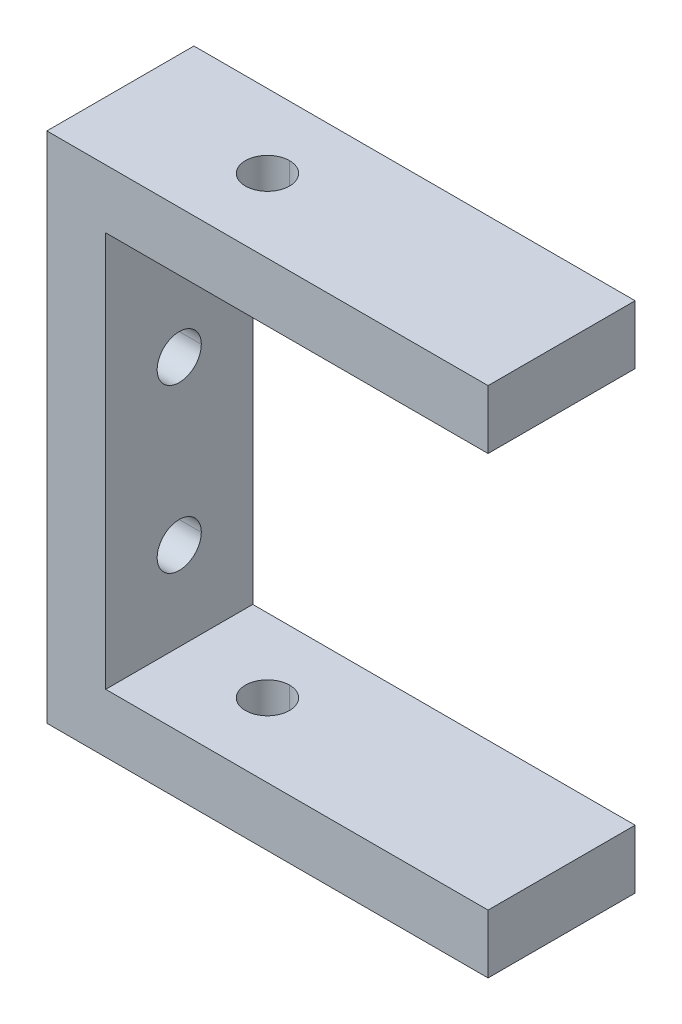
ISO-10303-21;
HEADER;
FILE_DESCRIPTION(('STEP AP214'),'2;1');
FILE_NAME('part.step','',(''),(''),'','','');
FILE_SCHEMA(('AUTOMOTIVE_DESIGN { 1 0 10303 214 1 1 1 1 }'));
ENDSEC;
DATA;
#1=APPLICATION_CONTEXT('core data for automotive mechanical design processes');
#2=APPLICATION_PROTOCOL_DEFINITION('international standard','automotive_design',2000,#1);
#3=PRODUCT_CONTEXT('',#1,'mechanical');
#4=PRODUCT('Part','Part','',(#3));
#5=PRODUCT_RELATED_PRODUCT_CATEGORY('part','',(#4));
#6=PRODUCT_DEFINITION_FORMATION('','',#4);
#7=PRODUCT_DEFINITION_CONTEXT('part definition',#1,'design');
#8=PRODUCT_DEFINITION('design','',#6,#7);
#9=PRODUCT_DEFINITION_SHAPE('','',#8);
#10=(LENGTH_UNIT() NAMED_UNIT(*) SI_UNIT(.MILLI.,.METRE.));
#11=(NAMED_UNIT(*) PLANE_ANGLE_UNIT() SI_UNIT($,.RADIAN.));
#12=(NAMED_UNIT(*) SI_UNIT($,.STERADIAN.) SOLID_ANGLE_UNIT());
#13=UNCERTAINTY_MEASURE_WITH_UNIT(LENGTH_MEASURE(1.E-05),#10,'distance_accuracy_value','');
#14=(GEOMETRIC_REPRESENTATION_CONTEXT(3) GLOBAL_UNCERTAINTY_ASSIGNED_CONTEXT((#13)) GLOBAL_UNIT_ASSIGNED_CONTEXT((#10,
#11,#12)) REPRESENTATION_CONTEXT('',''));
#15=CARTESIAN_POINT('',(0.,0.,0.));
#16=DIRECTION('',(0.,0.,1.));
#17=DIRECTION('',(1.,0.,0.));
#18=AXIS2_PLACEMENT_3D('',#15,#16,#17);
#19=CARTESIAN_POINT('',(-11.,4.,-5.));
#20=DIRECTION('',(0.,1.,0.));
#21=DIRECTION('',(0.,0.,1.));
#22=AXIS2_PLACEMENT_3D('',#19,#20,#21);
#23=PLANE('',#22);
#24=CARTESIAN_POINT('',(15.,4.,-5.));
#25=DIRECTION('',(-1.,0.,0.));
#26=VECTOR('',#25,1.);
#27=LINE('',#24,#26);
#28=CARTESIAN_POINT('',(15.,4.,-5.));
#29=VERTEX_POINT('',#28);
#30=CARTESIAN_POINT('',(-11.,4.,-5.));
#31=VERTEX_POINT('',#30);
#32=EDGE_CURVE('E11',#29,#31,#27,.T.);
#33=ORIENTED_EDGE('',*,*,#32,.T.);
#34=CARTESIAN_POINT('',(-11.,4.,-5.));
#35=DIRECTION('',(0.,0.,1.));
#36=VECTOR('',#35,1.);
#37=LINE('',#34,#36);
#38=CARTESIAN_POINT('',(-11.,4.,5.));
#39=VERTEX_POINT('',#38);
#40=EDGE_CURVE('E25',#31,#39,#37,.T.);
#41=ORIENTED_EDGE('',*,*,#40,.T.);
#42=CARTESIAN_POINT('',(-11.,4.,5.));
#43=DIRECTION('',(1.,0.,0.));
#44=VECTOR('',#43,1.);
#45=LINE('',#42,#44);
#46=CARTESIAN_POINT('',(15.,4.,5.));
#47=VERTEX_POINT('',#46);
#48=EDGE_CURVE('E907',#39,#47,#45,.T.);
#49=ORIENTED_EDGE('',*,*,#48,.T.);
#50=CARTESIAN_POINT('',(15.,4.,5.));
#51=DIRECTION('',(0.,0.,-1.));
#52=VECTOR('',#51,1.);
#53=LINE('',#50,#52);
#54=EDGE_CURVE('E773',#47,#29,#53,.T.);
#55=ORIENTED_EDGE('',*,*,#54,.T.);
#56=EDGE_LOOP('',(#33,#41,#49,#55));
#57=FACE_BOUND('',#56,.T.);
#58=CARTESIAN_POINT('',(-4.99999999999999,4.,0.));
#59=DIRECTION('',(0.,1.,0.));
#60=DIRECTION('',(0.,0.,-1.));
#61=AXIS2_PLACEMENT_3D('',#58,#59,#60);
#62=CIRCLE('',#61,1.5);
#63=CARTESIAN_POINT('',(-4.99999999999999,4.,-1.5));
#64=VERTEX_POINT('',#63);
#65=CARTESIAN_POINT('',(-4.99999999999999,4.,1.5));
#66=VERTEX_POINT('',#65);
#67=EDGE_CURVE('E763',#64,#66,#62,.T.);
#68=ORIENTED_EDGE('',*,*,#67,.F.);
#69=CARTESIAN_POINT('',(-4.99999999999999,4.,0.));
#70=DIRECTION('',(0.,1.,0.));
#71=DIRECTION('',(0.,0.,1.));
#72=AXIS2_PLACEMENT_3D('',#69,#70,#71);
#73=CIRCLE('',#72,1.5);
#74=EDGE_CURVE('E766',#66,#64,#73,.T.);
#75=ORIENTED_EDGE('',*,*,#74,.F.);
#76=EDGE_LOOP('',(#68,#75));
#77=FACE_BOUND('',#76,.T.);
#78=ADVANCED_FACE('F17',(#57,#77),#23,.T.);
#79=CARTESIAN_POINT('',(-4.99999999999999,4.,0.));
#80=DIRECTION('',(0.,-1.,0.));
#81=DIRECTION('',(-1.,0.,0.));
#82=AXIS2_PLACEMENT_3D('',#79,#80,#81);
#83=CYLINDRICAL_SURFACE('',#82,1.5);
#84=ORIENTED_EDGE('',*,*,#74,.T.);
#85=CARTESIAN_POINT('',(-4.99999999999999,4.,-1.5));
#86=DIRECTION('',(0.,-1.,0.));
#87=VECTOR('',#86,1.);
#88=LINE('',#85,#87);
#89=CARTESIAN_POINT('',(-4.99999999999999,0.,-1.5));
#90=VERTEX_POINT('',#89);
#91=EDGE_CURVE('E777',#64,#90,#88,.T.);
#92=ORIENTED_EDGE('',*,*,#91,.T.);
#93=CARTESIAN_POINT('',(-5.,0.,1.5));
#94=CARTESIAN_POINT('',(-4.8425842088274,0.,1.49993604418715));
#95=CARTESIAN_POINT('',(-4.6862272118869,0.,1.47523780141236));
#96=CARTESIAN_POINT('',(-4.3785572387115,0.,1.37529688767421));
#97=CARTESIAN_POINT('',(-4.2409014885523,0.,1.30258349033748));
#98=CARTESIAN_POINT('',(-3.9653646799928,0.,1.10234060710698));
#99=CARTESIAN_POINT('',(-3.8348007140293,0.,0.96327218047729));
#100=CARTESIAN_POINT('',(-3.476264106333,0.,0.39851786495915));
#101=CARTESIAN_POINT('',(-3.4285177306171,0.,-0.10584859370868));
#102=CARTESIAN_POINT('',(-3.6791555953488,0.,-0.73866314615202));
#103=CARTESIAN_POINT('',(-3.7896930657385,0.,-0.90843440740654));
#104=CARTESIAN_POINT('',(-4.0236138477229,0.,-1.14642133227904));
#105=CARTESIAN_POINT('',(-4.1291725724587,0.,-1.22855098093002));
#106=CARTESIAN_POINT('',(-4.3708968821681,0.,-1.36960084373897));
#107=CARTESIAN_POINT('',(-4.5104467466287,0.,-1.42716999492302));
#108=CARTESIAN_POINT('',(-4.7776706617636,0.,-1.48758436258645));
#109=CARTESIAN_POINT('',(-4.8886536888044,0.,-1.49995476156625));
#110=CARTESIAN_POINT('',(-5.,0.,-1.5));
#111=B_SPLINE_CURVE_WITH_KNOTS('',3,(#93,#94,#95,#96,#97,#98,#99,#100,#101,#102,#103,#104,#105,
#106,#107,#108,#109,#110),.UNSPECIFIED.,.F.,.F.,(4,2,2,2,2,2,2,2,4),(0.,0.0929611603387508,
0.190983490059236,0.313321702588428,0.624045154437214,0.753831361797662,0.839995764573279,
0.93494781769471,1.),.UNSPECIFIED.);
#112=CARTESIAN_POINT('',(-4.99999999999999,0.,1.5));
#113=VERTEX_POINT('',#112);
#114=EDGE_CURVE('E788',#113,#90,#111,.T.);
#115=ORIENTED_EDGE('',*,*,#114,.F.);
#116=CARTESIAN_POINT('',(-4.99999999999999,0.,1.5));
#117=DIRECTION('',(0.,1.,0.));
#118=VECTOR('',#117,1.);
#119=LINE('',#116,#118);
#120=EDGE_CURVE('E780',#113,#66,#119,.T.);
#121=ORIENTED_EDGE('',*,*,#120,.T.);
#122=EDGE_LOOP('',(#84,#92,#115,#121));
#123=FACE_BOUND('',#122,.T.);
#124=ADVANCED_FACE('F755',(#123),#83,.F.);
#125=CARTESIAN_POINT('',(-4.99999999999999,4.,0.));
#126=DIRECTION('',(0.,-1.,0.));
#127=DIRECTION('',(1.,0.,0.));
#128=AXIS2_PLACEMENT_3D('',#125,#126,#127);
#129=CYLINDRICAL_SURFACE('',#128,1.5);
#130=CARTESIAN_POINT('',(-5.,0.,-1.5));
#131=CARTESIAN_POINT('',(-5.15741579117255,0.,-1.49993604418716));
#132=CARTESIAN_POINT('',(-5.31377278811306,0.,-1.47523780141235));
#133=CARTESIAN_POINT('',(-5.62144276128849,0.,-1.37529688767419));
#134=CARTESIAN_POINT('',(-5.75909851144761,0.,-1.30258349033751));
#135=CARTESIAN_POINT('',(-6.03463532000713,0.,-1.10234060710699));
#136=CARTESIAN_POINT('',(-6.16519928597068,0.,-0.96327218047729));
#137=CARTESIAN_POINT('',(-6.52373589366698,0.,-0.39851786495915));
#138=CARTESIAN_POINT('',(-6.57148226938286,0.,0.10584859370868));
#139=CARTESIAN_POINT('',(-6.32084440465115,0.,0.73866314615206));
#140=CARTESIAN_POINT('',(-6.21030693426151,0.,0.9084344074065));
#141=CARTESIAN_POINT('',(-5.9763861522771,0.,1.14642133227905));
#142=CARTESIAN_POINT('',(-5.87082742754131,0.,1.22855098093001));
#143=CARTESIAN_POINT('',(-5.62910311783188,0.,1.36960084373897));
#144=CARTESIAN_POINT('',(-5.48955325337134,0.,1.42716999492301));
#145=CARTESIAN_POINT('',(-5.22232933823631,0.,1.48758436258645));
#146=CARTESIAN_POINT('',(-5.11134631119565,0.,1.49995476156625));
#147=CARTESIAN_POINT('',(-5.,0.,1.5));
#148=B_SPLINE_CURVE_WITH_KNOTS('',3,(#130,#131,#132,#133,#134,#135,#136,#137,#138,#139,#140,
#141,#142,#143,#144,#145,#146,#147),.UNSPECIFIED.,.F.,.F.,(4,2,2,2,2,2,2,2,4),(0.,
0.0929611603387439,0.190983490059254,0.313321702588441,0.62404515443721,0.753831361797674,
0.839995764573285,0.934947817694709,1.),.UNSPECIFIED.);
#149=EDGE_CURVE('E442',#90,#113,#148,.T.);
#150=ORIENTED_EDGE('',*,*,#149,.F.);
#151=ORIENTED_EDGE('',*,*,#91,.F.);
#152=ORIENTED_EDGE('',*,*,#67,.T.);
#153=ORIENTED_EDGE('',*,*,#120,.F.);
#154=EDGE_LOOP('',(#150,#151,#152,#153));
#155=FACE_BOUND('',#154,.T.);
#156=ADVANCED_FACE('F759',(#155),#129,.F.);
#157=CARTESIAN_POINT('',(-15.,0.,-5.));
#158=DIRECTION('',(0.,-1.,0.));
#159=DIRECTION('',(1.,0.,0.));
#160=AXIS2_PLACEMENT_3D('',#157,#158,#159);
#161=PLANE('',#160);
#162=CARTESIAN_POINT('',(15.,0.,5.));
#163=DIRECTION('',(0.,0.,-1.));
#164=VECTOR('',#163,1.);
#165=LINE('',#162,#164);
#166=CARTESIAN_POINT('',(15.,0.,5.));
#167=VERTEX_POINT('',#166);
#168=CARTESIAN_POINT('',(15.,0.,-5.));
#169=VERTEX_POINT('',#168);
#170=EDGE_CURVE('E435',#167,#169,#165,.T.);
#171=ORIENTED_EDGE('',*,*,#170,.F.);
#172=CARTESIAN_POINT('',(-15.,0.,5.));
#173=DIRECTION('',(1.,0.,0.));
#174=VECTOR('',#173,1.);
#175=LINE('',#172,#174);
#176=CARTESIAN_POINT('',(-15.,0.,5.));
#177=VERTEX_POINT('',#176);
#178=EDGE_CURVE('E443',#177,#167,#175,.T.);
#179=ORIENTED_EDGE('',*,*,#178,.F.);
#180=CARTESIAN_POINT('',(-15.,0.,-5.));
#181=DIRECTION('',(0.,0.,1.));
#182=VECTOR('',#181,1.);
#183=LINE('',#180,#182);
#184=CARTESIAN_POINT('',(-15.,0.,-5.));
#185=VERTEX_POINT('',#184);
#186=EDGE_CURVE('E296',#185,#177,#183,.T.);
#187=ORIENTED_EDGE('',*,*,#186,.F.);
#188=CARTESIAN_POINT('',(15.,0.,-5.));
#189=DIRECTION('',(-1.,0.,0.));
#190=VECTOR('',#189,1.);
#191=LINE('',#188,#190);
#192=EDGE_CURVE('E427',#169,#185,#191,.T.);
#193=ORIENTED_EDGE('',*,*,#192,.F.);
#194=EDGE_LOOP('',(#171,#179,#187,#193));
#195=FACE_BOUND('',#194,.T.);
#196=ORIENTED_EDGE('',*,*,#114,.T.);
#197=ORIENTED_EDGE('',*,*,#149,.T.);
#198=EDGE_LOOP('',(#196,#197));
#199=FACE_BOUND('',#198,.T.);
#200=ADVANCED_FACE('F459',(#195,#199),#161,.T.);
#201=CARTESIAN_POINT('',(-15.,0.,-5.));
#202=DIRECTION('',(0.,0.,-1.));
#203=DIRECTION('',(0.,1.,0.));
#204=AXIS2_PLACEMENT_3D('',#201,#202,#203);
#205=PLANE('',#204);
#206=ORIENTED_EDGE('',*,*,#192,.T.);
#207=CARTESIAN_POINT('',(-15.,34.8844383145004,-5.));
#208=DIRECTION('',(0.,-1.,0.));
#209=VECTOR('',#208,1.);
#210=LINE('',#207,#209);
#211=CARTESIAN_POINT('',(-15.,34.8844383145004,-5.00000000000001));
#212=VERTEX_POINT('',#211);
#213=EDGE_CURVE('E504',#212,#185,#210,.T.);
#214=ORIENTED_EDGE('',*,*,#213,.F.);
#215=CARTESIAN_POINT('',(15.,34.8844383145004,-5.00000000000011));
#216=DIRECTION('',(-1.,0.,0.));
#217=VECTOR('',#216,1.);
#218=LINE('',#215,#217);
#219=CARTESIAN_POINT('',(15.,34.8844383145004,-5.00000000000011));
#220=VERTEX_POINT('',#219);
#221=EDGE_CURVE('E419',#220,#212,#218,.T.);
#222=ORIENTED_EDGE('',*,*,#221,.F.);
#223=CARTESIAN_POINT('',(15.,34.8844383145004,-5.));
#224=DIRECTION('',(0.,-1.,0.));
#225=VECTOR('',#224,1.);
#226=LINE('',#223,#225);
#227=CARTESIAN_POINT('',(15.,30.8844383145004,-5.00000000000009));
#228=VERTEX_POINT('',#227);
#229=EDGE_CURVE('E358',#220,#228,#226,.T.);
#230=ORIENTED_EDGE('',*,*,#229,.T.);
#231=CARTESIAN_POINT('',(15.,30.8844383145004,-5.));
#232=DIRECTION('',(-1.,0.,0.));
#233=VECTOR('',#232,1.);
#234=LINE('',#231,#233);
#235=CARTESIAN_POINT('',(-11.,30.8844383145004,-5.00000000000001));
#236=VERTEX_POINT('',#235);
#237=EDGE_CURVE('E408',#228,#236,#234,.T.);
#238=ORIENTED_EDGE('',*,*,#237,.T.);
#239=CARTESIAN_POINT('',(-11.,30.8844383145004,-5.));
#240=DIRECTION('',(0.,-1.,0.));
#241=VECTOR('',#240,1.);
#242=LINE('',#239,#241);
#243=EDGE_CURVE('E418',#236,#31,#242,.T.);
#244=ORIENTED_EDGE('',*,*,#243,.T.);
#245=ORIENTED_EDGE('',*,*,#32,.F.);
#246=CARTESIAN_POINT('',(15.,4.,-5.));
#247=DIRECTION('',(0.,-1.,0.));
#248=VECTOR('',#247,1.);
#249=LINE('',#246,#248);
#250=EDGE_CURVE('E303',#29,#169,#249,.T.);
#251=ORIENTED_EDGE('',*,*,#250,.T.);
#252=EDGE_LOOP('',(#206,#214,#222,#230,#238,#244,#245,#251));
#253=FACE_BOUND('',#252,.T.);
#254=ADVANCED_FACE('F426',(#253),#205,.T.);
#255=CARTESIAN_POINT('',(15.,0.,-5.));
#256=DIRECTION('',(1.,0.,0.));
#257=DIRECTION('',(0.,1.,0.));
#258=AXIS2_PLACEMENT_3D('',#255,#256,#257);
#259=PLANE('',#258);
#260=ORIENTED_EDGE('',*,*,#170,.T.);
#261=ORIENTED_EDGE('',*,*,#250,.F.);
#262=ORIENTED_EDGE('',*,*,#54,.F.);
#263=CARTESIAN_POINT('',(15.,4.,5.));
#264=DIRECTION('',(0.,-1.,0.));
#265=VECTOR('',#264,1.);
#266=LINE('',#263,#265);
#267=EDGE_CURVE('E300',#47,#167,#266,.T.);
#268=ORIENTED_EDGE('',*,*,#267,.T.);
#269=EDGE_LOOP('',(#260,#261,#262,#268));
#270=FACE_BOUND('',#269,.T.);
#271=ADVANCED_FACE('F437',(#270),#259,.T.);
#272=CARTESIAN_POINT('',(15.,0.,5.));
#273=DIRECTION('',(0.,0.,1.));
#274=DIRECTION('',(0.,1.,0.));
#275=AXIS2_PLACEMENT_3D('',#272,#273,#274);
#276=PLANE('',#275);
#277=CARTESIAN_POINT('',(-15.,34.8844383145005,5.));
#278=DIRECTION('',(0.,-1.,0.));
#279=VECTOR('',#278,1.);
#280=LINE('',#277,#279);
#281=CARTESIAN_POINT('',(-15.,34.8844383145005,4.99999999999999));
#282=VERTEX_POINT('',#281);
#283=EDGE_CURVE('E295',#282,#177,#280,.T.);
#284=ORIENTED_EDGE('',*,*,#283,.T.);
#285=ORIENTED_EDGE('',*,*,#178,.T.);
#286=ORIENTED_EDGE('',*,*,#267,.F.);
#287=ORIENTED_EDGE('',*,*,#48,.F.);
#288=CARTESIAN_POINT('',(-11.,4.,5.));
#289=DIRECTION('',(0.,1.,0.));
#290=VECTOR('',#289,1.);
#291=LINE('',#288,#290);
#292=CARTESIAN_POINT('',(-11.,30.8844383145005,4.99999999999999));
#293=VERTEX_POINT('',#292);
#294=EDGE_CURVE('E301',#39,#293,#291,.T.);
#295=ORIENTED_EDGE('',*,*,#294,.T.);
#296=CARTESIAN_POINT('',(-11.,30.8844383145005,5.));
#297=DIRECTION('',(1.,0.,0.));
#298=VECTOR('',#297,1.);
#299=LINE('',#296,#298);
#300=CARTESIAN_POINT('',(15.,30.8844383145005,4.99999999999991));
#301=VERTEX_POINT('',#300);
#302=EDGE_CURVE('E304',#293,#301,#299,.T.);
#303=ORIENTED_EDGE('',*,*,#302,.T.);
#304=CARTESIAN_POINT('',(15.,34.8844383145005,4.99999999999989));
#305=DIRECTION('',(0.,-1.,0.));
#306=VECTOR('',#305,1.);
#307=LINE('',#304,#306);
#308=CARTESIAN_POINT('',(15.,34.8844383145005,4.99999999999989));
#309=VERTEX_POINT('',#308);
#310=EDGE_CURVE('E308',#309,#301,#307,.T.);
#311=ORIENTED_EDGE('',*,*,#310,.F.);
#312=CARTESIAN_POINT('',(-15.,34.8844383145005,4.99999999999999));
#313=DIRECTION('',(1.,0.,0.));
#314=VECTOR('',#313,1.);
#315=LINE('',#312,#314);
#316=EDGE_CURVE('E312',#282,#309,#315,.T.);
#317=ORIENTED_EDGE('',*,*,#316,.F.);
#318=EDGE_LOOP('',(#284,#285,#286,#287,#295,#303,#311,#317));
#319=FACE_BOUND('',#318,.T.);
#320=ADVANCED_FACE('F525',(#319),#276,.T.);
#321=CARTESIAN_POINT('',(-15.,34.8844383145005,4.99999999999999));
#322=DIRECTION('',(0.,1.,0.));
#323=DIRECTION('',(1.,0.,0.));
#324=AXIS2_PLACEMENT_3D('',#321,#322,#323);
#325=PLANE('',#324);
#326=CARTESIAN_POINT('',(-15.,34.8844383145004,-5.));
#327=DIRECTION('',(0.,0.,1.));
#328=VECTOR('',#327,1.);
#329=LINE('',#326,#328);
#330=EDGE_CURVE('E285',#212,#282,#329,.T.);
#331=ORIENTED_EDGE('',*,*,#330,.T.);
#332=ORIENTED_EDGE('',*,*,#316,.T.);
#333=CARTESIAN_POINT('',(15.,34.8844383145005,4.9999999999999));
#334=DIRECTION('',(0.,0.,-1.));
#335=VECTOR('',#334,1.);
#336=LINE('',#333,#335);
#337=EDGE_CURVE('E321',#309,#220,#336,.T.);
#338=ORIENTED_EDGE('',*,*,#337,.T.);
#339=ORIENTED_EDGE('',*,*,#221,.T.);
#340=EDGE_LOOP('',(#331,#332,#338,#339));
#341=FACE_BOUND('',#340,.T.);
#342=CARTESIAN_POINT('',(-4.99999999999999,34.8844383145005,-2.15144730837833E-13));
#343=DIRECTION('',(0.,1.,0.));
#344=DIRECTION('',(0.,0.,-1.));
#345=AXIS2_PLACEMENT_3D('',#342,#343,#344);
#346=CIRCLE('',#345,1.5);
#347=CARTESIAN_POINT('',(-4.99999999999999,34.8844383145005,-1.50000000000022));
#348=VERTEX_POINT('',#347);
#349=CARTESIAN_POINT('',(-4.99999999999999,34.8844383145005,1.49999999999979));
#350=VERTEX_POINT('',#349);
#351=EDGE_CURVE('E324',#348,#350,#346,.T.);
#352=ORIENTED_EDGE('',*,*,#351,.F.);
#353=CARTESIAN_POINT('',(-4.99999999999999,34.8844383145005,-2.15144730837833E-13));
#354=DIRECTION('',(0.,1.,0.));
#355=DIRECTION('',(0.,0.,1.));
#356=AXIS2_PLACEMENT_3D('',#353,#354,#355);
#357=CIRCLE('',#356,1.5);
#358=EDGE_CURVE('E328',#350,#348,#357,.T.);
#359=ORIENTED_EDGE('',*,*,#358,.F.);
#360=EDGE_LOOP('',(#352,#359));
#361=FACE_BOUND('',#360,.T.);
#362=ADVANCED_FACE('F506',(#341,#361),#325,.T.);
#363=CARTESIAN_POINT('',(-4.99999999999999,34.8844383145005,-2.15144730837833E-13));
#364=DIRECTION('',(0.,-1.,0.));
#365=DIRECTION('',(-1.,0.,0.));
#366=AXIS2_PLACEMENT_3D('',#363,#364,#365);
#367=CYLINDRICAL_SURFACE('',#366,1.5);
#368=ORIENTED_EDGE('',*,*,#358,.T.);
#369=CARTESIAN_POINT('',(-4.99999999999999,34.8844383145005,-1.50000000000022));
#370=DIRECTION('',(0.,-1.,0.));
#371=VECTOR('',#370,1.);
#372=LINE('',#369,#371);
#373=CARTESIAN_POINT('',(-4.99999999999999,30.8844383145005,-1.50000000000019));
#374=VERTEX_POINT('',#373);
#375=EDGE_CURVE('E334',#348,#374,#372,.T.);
#376=ORIENTED_EDGE('',*,*,#375,.T.);
#377=CARTESIAN_POINT('',(-5.,30.8844383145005,1.49999999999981));
#378=CARTESIAN_POINT('',(-4.84258420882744,30.8844383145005,1.49993604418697));
#379=CARTESIAN_POINT('',(-4.68622721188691,30.8844383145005,1.47523780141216));
#380=CARTESIAN_POINT('',(-4.34625197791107,30.8844383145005,1.36480311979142));
#381=CARTESIAN_POINT('',(-4.1838157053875,30.8844383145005,1.27153089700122));
#382=CARTESIAN_POINT('',(-3.54217404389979,30.8844383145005,0.74061157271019));
#383=CARTESIAN_POINT('',(-3.36631266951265,30.8844383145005,0.0512077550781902));
#384=CARTESIAN_POINT('',(-3.67915559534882,30.8844383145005,-0.73866314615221));
#385=CARTESIAN_POINT('',(-3.78969306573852,30.8844383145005,-0.90843440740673));
#386=CARTESIAN_POINT('',(-4.02361384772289,30.8844383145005,-1.14642133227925));
#387=CARTESIAN_POINT('',(-4.12917257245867,30.8844383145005,-1.22855098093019));
#388=CARTESIAN_POINT('',(-4.37422776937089,30.8844383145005,-1.37154446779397));
#389=CARTESIAN_POINT('',(-4.51622789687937,30.8844383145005,-1.4284770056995));
#390=CARTESIAN_POINT('',(-4.77767066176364,30.8844383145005,-1.48758436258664));
#391=CARTESIAN_POINT('',(-4.88865368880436,30.8844383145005,-1.49995476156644));
#392=CARTESIAN_POINT('',(-5.,30.8844383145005,-1.50000000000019));
#393=B_SPLINE_CURVE_WITH_KNOTS('',3,(#377,#378,#379,#380,#381,#382,#383,#384,#385,#386,#387,
#388,#389,#390,#391,#392),.UNSPECIFIED.,.F.,.F.,(4,2,2,2,2,2,2,4),(0.,0.0911318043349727,
0.206883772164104,0.621900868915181,0.75013134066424,0.835262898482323,0.931542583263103,1.),.UNSPECIFIED.);
#394=CARTESIAN_POINT('',(-4.99999999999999,30.8844383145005,1.49999999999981));
#395=VERTEX_POINT('',#394);
#396=EDGE_CURVE('E338',#395,#374,#393,.T.);
#397=ORIENTED_EDGE('',*,*,#396,.F.);
#398=CARTESIAN_POINT('',(-4.99999999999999,30.8844383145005,1.49999999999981));
#399=DIRECTION('',(0.,1.,0.));
#400=VECTOR('',#399,1.);
#401=LINE('',#398,#400);
#402=EDGE_CURVE('E342',#395,#350,#401,.T.);
#403=ORIENTED_EDGE('',*,*,#402,.T.);
#404=EDGE_LOOP('',(#368,#376,#397,#403));
#405=FACE_BOUND('',#404,.T.);
#406=ADVANCED_FACE('F524',(#405),#367,.F.);
#407=CARTESIAN_POINT('',(-4.99999999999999,34.8844383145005,-2.15144730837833E-13));
#408=DIRECTION('',(0.,-1.,0.));
#409=DIRECTION('',(1.,0.,0.));
#410=AXIS2_PLACEMENT_3D('',#407,#408,#409);
#411=CYLINDRICAL_SURFACE('',#410,1.5);
#412=CARTESIAN_POINT('',(-5.,30.8844383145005,-1.50000000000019));
#413=CARTESIAN_POINT('',(-5.15741579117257,30.8844383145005,-1.49993604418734));
#414=CARTESIAN_POINT('',(-5.31377278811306,30.8844383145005,-1.47523780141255));
#415=CARTESIAN_POINT('',(-5.65374802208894,30.8844383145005,-1.36480311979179));
#416=CARTESIAN_POINT('',(-5.81618429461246,30.8844383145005,-1.27153089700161));
#417=CARTESIAN_POINT('',(-6.4578259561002,30.8844383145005,-0.740611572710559));
#418=CARTESIAN_POINT('',(-6.63368733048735,30.8844383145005,-0.0512077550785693));
#419=CARTESIAN_POINT('',(-6.32084440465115,30.8844383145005,0.738663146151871));
#420=CARTESIAN_POINT('',(-6.2103069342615,30.8844383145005,0.90843440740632));
#421=CARTESIAN_POINT('',(-5.9763861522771,30.8844383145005,1.14642133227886));
#422=CARTESIAN_POINT('',(-5.8708274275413,30.8844383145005,1.22855098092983));
#423=CARTESIAN_POINT('',(-5.6257722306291,30.8844383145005,1.37154446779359));
#424=CARTESIAN_POINT('',(-5.48377210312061,30.8844383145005,1.42847700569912));
#425=CARTESIAN_POINT('',(-5.22232933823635,30.8844383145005,1.48758436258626));
#426=CARTESIAN_POINT('',(-5.11134631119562,30.8844383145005,1.49995476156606));
#427=CARTESIAN_POINT('',(-5.,30.8844383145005,1.49999999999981));
#428=B_SPLINE_CURVE_WITH_KNOTS('',3,(#412,#413,#414,#415,#416,#417,#418,#419,#420,#421,#422,
#423,#424,#425,#426,#427),.UNSPECIFIED.,.F.,.F.,(4,2,2,2,2,2,2,4),(0.,0.0911318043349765,
0.206883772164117,0.621900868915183,0.750131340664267,0.835262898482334,0.931542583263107,1.),.UNSPECIFIED.);
#429=EDGE_CURVE('E346',#374,#395,#428,.T.);
#430=ORIENTED_EDGE('',*,*,#429,.F.);
#431=ORIENTED_EDGE('',*,*,#375,.F.);
#432=ORIENTED_EDGE('',*,*,#351,.T.);
#433=ORIENTED_EDGE('',*,*,#402,.F.);
#434=EDGE_LOOP('',(#430,#431,#432,#433));
#435=FACE_BOUND('',#434,.T.);
#436=ADVANCED_FACE('F379',(#435),#411,.F.);
#437=CARTESIAN_POINT('',(-11.,30.8844383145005,4.99999999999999));
#438=DIRECTION('',(0.,-1.,0.));
#439=DIRECTION('',(0.,0.,-1.));
#440=AXIS2_PLACEMENT_3D('',#437,#438,#439);
#441=PLANE('',#440);
#442=ORIENTED_EDGE('',*,*,#302,.F.);
#443=CARTESIAN_POINT('',(-11.,30.8844383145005,4.99999999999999));
#444=DIRECTION('',(0.,0.,-1.));
#445=VECTOR('',#444,1.);
#446=LINE('',#443,#445);
#447=EDGE_CURVE('E348',#293,#236,#446,.T.);
#448=ORIENTED_EDGE('',*,*,#447,.T.);
#449=ORIENTED_EDGE('',*,*,#237,.F.);
#450=CARTESIAN_POINT('',(15.,30.8844383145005,4.99999999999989));
#451=DIRECTION('',(0.,0.,-1.));
#452=VECTOR('',#451,1.);
#453=LINE('',#450,#452);
#454=EDGE_CURVE('E204',#301,#228,#453,.T.);
#455=ORIENTED_EDGE('',*,*,#454,.F.);
#456=EDGE_LOOP('',(#442,#448,#449,#455));
#457=FACE_BOUND('',#456,.T.);
#458=ORIENTED_EDGE('',*,*,#396,.T.);
#459=ORIENTED_EDGE('',*,*,#429,.T.);
#460=EDGE_LOOP('',(#458,#459));
#461=FACE_BOUND('',#460,.T.);
#462=ADVANCED_FACE('F370',(#457,#461),#441,.T.);
#463=CARTESIAN_POINT('',(15.,30.8844383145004,-5.00000000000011));
#464=DIRECTION('',(1.,0.,0.));
#465=DIRECTION('',(0.,1.,0.));
#466=AXIS2_PLACEMENT_3D('',#463,#464,#465);
#467=PLANE('',#466);
#468=ORIENTED_EDGE('',*,*,#454,.T.);
#469=ORIENTED_EDGE('',*,*,#229,.F.);
#470=ORIENTED_EDGE('',*,*,#337,.F.);
#471=ORIENTED_EDGE('',*,*,#310,.T.);
#472=EDGE_LOOP('',(#468,#469,#470,#471));
#473=FACE_BOUND('',#472,.T.);
#474=ADVANCED_FACE('F357',(#473),#467,.T.);
#475=CARTESIAN_POINT('',(-11.,4.,-5.00000000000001));
#476=DIRECTION('',(1.,0.,0.));
#477=DIRECTION('',(0.,1.,0.));
#478=AXIS2_PLACEMENT_3D('',#475,#476,#477);
#479=PLANE('',#478);
#480=ORIENTED_EDGE('',*,*,#40,.F.);
#481=ORIENTED_EDGE('',*,*,#243,.F.);
#482=ORIENTED_EDGE('',*,*,#447,.F.);
#483=ORIENTED_EDGE('',*,*,#294,.F.);
#484=EDGE_LOOP('',(#480,#481,#482,#483));
#485=FACE_BOUND('',#484,.T.);
#486=CARTESIAN_POINT('',(-11.,21.0670112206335,-1.5000000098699));
#487=CARTESIAN_POINT('',(-11.,20.9972946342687,-1.50000018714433));
#488=CARTESIAN_POINT('',(-11.,20.9275738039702,-1.49515344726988));
#489=CARTESIAN_POINT('',(-11.,20.8512965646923,-1.48445820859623));
#490=CARTESIAN_POINT('',(-11.,20.8441973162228,-1.48341217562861));
#491=CARTESIAN_POINT('',(-11.,20.6641504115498,-1.45560171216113));
#492=CARTESIAN_POINT('',(-11.,20.5076243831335,-1.40119058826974));
#493=CARTESIAN_POINT('',(-11.,20.1722505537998,-1.22345016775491));
#494=CARTESIAN_POINT('',(-11.,20.0137796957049,-1.08706429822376));
#495=CARTESIAN_POINT('',(-11.,19.5446689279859,-0.490988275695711));
#496=CARTESIAN_POINT('',(-11.,19.4704489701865,0.0998130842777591));
#497=CARTESIAN_POINT('',(-11.,19.7741275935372,0.78484978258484));
#498=CARTESIAN_POINT('',(-11.,19.8862688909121,0.94512261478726));
#499=CARTESIAN_POINT('',(-11.,20.118338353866,1.16896103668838));
#500=CARTESIAN_POINT('',(-11.,20.2220446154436,1.24601313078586));
#501=CARTESIAN_POINT('',(-11.,20.4610631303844,1.37985066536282));
#502=CARTESIAN_POINT('',(-11.,20.5987950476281,1.43311431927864));
#503=CARTESIAN_POINT('',(-11.,20.8521488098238,1.48840375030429));
#504=CARTESIAN_POINT('',(-11.,20.9594159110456,1.49995562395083));
#505=CARTESIAN_POINT('',(-11.,21.0670112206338,1.50000000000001));
#506=B_SPLINE_CURVE_WITH_KNOTS('',3,(#486,#487,#488,#489,#490,#491,#492,#493,#494,#495,#496,
#497,#498,#499,#500,#501,#502,#503,#504,#505),.UNSPECIFIED.,.F.,.F.,(4,2,2,2,2,2,2,2,2,4),(0.,
0.0386200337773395,0.0426003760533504,0.13995956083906,0.271415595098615,0.630805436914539,
0.756134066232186,0.839350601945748,0.933320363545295,1.),.UNSPECIFIED.);
#507=CARTESIAN_POINT('',(-11.,21.0670112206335,-1.5000000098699));
#508=VERTEX_POINT('',#507);
#509=CARTESIAN_POINT('',(-11.,21.0670112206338,1.5));
#510=VERTEX_POINT('',#509);
#511=EDGE_CURVE('E145',#508,#510,#506,.T.);
#512=ORIENTED_EDGE('',*,*,#511,.T.);
#513=CARTESIAN_POINT('',(-11.,21.0670112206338,1.50000000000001));
#514=CARTESIAN_POINT('',(-11.,21.1934291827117,1.49994786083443));
#515=CARTESIAN_POINT('',(-11.,21.3193054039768,1.48400978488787));
#516=CARTESIAN_POINT('',(-11.,21.6301369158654,1.40385400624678));
#517=CARTESIAN_POINT('',(-11.,21.7917017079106,1.32482525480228));
#518=CARTESIAN_POINT('',(-11.,22.1145648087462,1.09615459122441));
#519=CARTESIAN_POINT('',(-11.,22.2623528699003,0.931773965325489));
#520=CARTESIAN_POINT('',(-11.,22.6109997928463,0.32075618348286));
#521=CARTESIAN_POINT('',(-11.,22.6321784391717,-0.1931399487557));
#522=CARTESIAN_POINT('',(-11.,22.3550067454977,-0.787172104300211));
#523=CARTESIAN_POINT('',(-11.,22.2580829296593,-0.92722532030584));
#524=CARTESIAN_POINT('',(-11.,22.0109488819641,-1.18018027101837));
#525=CARTESIAN_POINT('',(-11.,21.8567569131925,-1.29071299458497));
#526=CARTESIAN_POINT('',(-11.,21.5525550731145,-1.42558988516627));
#527=CARTESIAN_POINT('',(-11.,21.4237021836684,-1.46315654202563));
#528=CARTESIAN_POINT('',(-11.,21.2171590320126,-1.49437880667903));
#529=CARTESIAN_POINT('',(-11.,21.1420875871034,-1.49999981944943));
#530=CARTESIAN_POINT('',(-11.,21.0670112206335,-1.5000000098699));
#531=B_SPLINE_CURVE_WITH_KNOTS('',3,(#513,#514,#515,#516,#517,#518,#519,#520,#521,#522,#523,
#524,#525,#526,#527,#528,#529,#530),.UNSPECIFIED.,.F.,.F.,(4,2,2,2,2,2,2,2,4),(0.,
0.0724246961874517,0.183840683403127,0.325562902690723,0.642971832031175,0.753297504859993,
0.873703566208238,0.954537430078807,1.),.UNSPECIFIED.);
#532=EDGE_CURVE('E193',#510,#508,#531,.T.);
#533=ORIENTED_EDGE('',*,*,#532,.T.);
#534=EDGE_LOOP('',(#512,#533));
#535=FACE_BOUND('',#534,.T.);
#536=CARTESIAN_POINT('',(-11.,9.99999999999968,-1.5000000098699));
#537=CARTESIAN_POINT('',(-11.,9.93028341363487,-1.50000018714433));
#538=CARTESIAN_POINT('',(-11.,9.86056258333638,-1.49515344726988));
#539=CARTESIAN_POINT('',(-11.,9.78428534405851,-1.48445820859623));
#540=CARTESIAN_POINT('',(-11.,9.77718609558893,-1.4834121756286));
#541=CARTESIAN_POINT('',(-11.,9.5971391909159,-1.45560171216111));
#542=CARTESIAN_POINT('',(-11.,9.44061316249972,-1.40119058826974));
#543=CARTESIAN_POINT('',(-11.,9.10523933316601,-1.22345016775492));
#544=CARTESIAN_POINT('',(-11.,8.9467684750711,-1.08706429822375));
#545=CARTESIAN_POINT('',(-11.,8.47765770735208,-0.4909882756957));
#546=CARTESIAN_POINT('',(-11.,8.40343774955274,0.0998130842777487));
#547=CARTESIAN_POINT('',(-11.,8.70711637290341,0.78484978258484));
#548=CARTESIAN_POINT('',(-11.,8.81925767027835,0.94512261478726));
#549=CARTESIAN_POINT('',(-11.,9.05132713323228,1.16896103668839));
#550=CARTESIAN_POINT('',(-11.,9.15503339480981,1.24601313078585));
#551=CARTESIAN_POINT('',(-11.,9.39405190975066,1.37985066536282));
#552=CARTESIAN_POINT('',(-11.,9.53178382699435,1.43311431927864));
#553=CARTESIAN_POINT('',(-11.,9.78513758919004,1.48840375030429));
#554=CARTESIAN_POINT('',(-11.,9.89240469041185,1.49995562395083));
#555=CARTESIAN_POINT('',(-11.,10.,1.5));
#556=B_SPLINE_CURVE_WITH_KNOTS('',3,(#536,#537,#538,#539,#540,#541,#542,#543,#544,#545,#546,
#547,#548,#549,#550,#551,#552,#553,#554,#555),.UNSPECIFIED.,.F.,.F.,(4,2,2,2,2,2,2,2,2,4),(0.,
0.0386200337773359,0.0426003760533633,0.13995956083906,0.271415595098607,0.63080543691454,
0.756134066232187,0.839350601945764,0.933320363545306,1.),.UNSPECIFIED.);
#557=CARTESIAN_POINT('',(-11.,9.99999999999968,-1.5000000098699));
#558=VERTEX_POINT('',#557);
#559=CARTESIAN_POINT('',(-11.,10.,1.5));
#560=VERTEX_POINT('',#559);
#561=EDGE_CURVE('E203',#558,#560,#556,.T.);
#562=ORIENTED_EDGE('',*,*,#561,.T.);
#563=CARTESIAN_POINT('',(-11.,10.,1.5));
#564=CARTESIAN_POINT('',(-11.,10.126417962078,1.49994786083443));
#565=CARTESIAN_POINT('',(-11.,10.252294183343,1.48400978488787));
#566=CARTESIAN_POINT('',(-11.,10.5631256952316,1.40385400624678));
#567=CARTESIAN_POINT('',(-11.,10.7246904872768,1.32482525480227));
#568=CARTESIAN_POINT('',(-11.,11.0475535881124,1.09615459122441));
#569=CARTESIAN_POINT('',(-11.,11.1953416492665,0.931773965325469));
#570=CARTESIAN_POINT('',(-11.,11.5439885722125,0.32075618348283));
#571=CARTESIAN_POINT('',(-11.,11.565167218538,-0.19313994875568));
#572=CARTESIAN_POINT('',(-11.,11.287995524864,-0.787172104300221));
#573=CARTESIAN_POINT('',(-11.,11.1910717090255,-0.92722532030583));
#574=CARTESIAN_POINT('',(-11.,10.9439376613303,-1.18018027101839));
#575=CARTESIAN_POINT('',(-11.,10.7897456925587,-1.29071299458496));
#576=CARTESIAN_POINT('',(-11.,10.4855438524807,-1.42558988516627));
#577=CARTESIAN_POINT('',(-11.,10.3566909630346,-1.46315654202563));
#578=CARTESIAN_POINT('',(-11.,10.1501478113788,-1.49437880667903));
#579=CARTESIAN_POINT('',(-11.,10.0750763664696,-1.49999981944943));
#580=CARTESIAN_POINT('',(-11.,9.99999999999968,-1.5000000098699));
#581=B_SPLINE_CURVE_WITH_KNOTS('',3,(#563,#564,#565,#566,#567,#568,#569,#570,#571,#572,#573,
#574,#575,#576,#577,#578,#579,#580),.UNSPECIFIED.,.F.,.F.,(4,2,2,2,2,2,2,2,4),(0.,
0.0724246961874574,0.183840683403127,0.325562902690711,0.642971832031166,0.753297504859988,
0.87370356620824,0.95453743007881,1.),.UNSPECIFIED.);
#582=EDGE_CURVE('E205',#560,#558,#581,.T.);
#583=ORIENTED_EDGE('',*,*,#582,.T.);
#584=EDGE_LOOP('',(#562,#583));
#585=FACE_BOUND('',#584,.T.);
#586=ADVANCED_FACE('F623',(#485,#535,#585),#479,.T.);
#587=CARTESIAN_POINT('',(-11.,10.,0.));
#588=DIRECTION('',(-1.,0.,0.));
#589=DIRECTION('',(0.,-1.,1.06864687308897E-13));
#590=AXIS2_PLACEMENT_3D('',#587,#588,#589);
#591=CYLINDRICAL_SURFACE('',#590,1.5);
#592=ORIENTED_EDGE('',*,*,#582,.F.);
#593=CARTESIAN_POINT('',(-11.,10.,1.5));
#594=DIRECTION('',(-1.,0.,0.));
#595=VECTOR('',#594,1.);
#596=LINE('',#593,#595);
#597=CARTESIAN_POINT('',(-15.,10.,1.50000000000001));
#598=VERTEX_POINT('',#597);
#599=EDGE_CURVE('E210',#560,#598,#596,.T.);
#600=ORIENTED_EDGE('',*,*,#599,.T.);
#601=CARTESIAN_POINT('',(-15.,10.,0.));
#602=DIRECTION('',(-1.,0.,0.));
#603=DIRECTION('',(0.,0.,1.));
#604=AXIS2_PLACEMENT_3D('',#601,#602,#603);
#605=CIRCLE('',#604,1.5);
#606=CARTESIAN_POINT('',(-15.,10.0000000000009,-1.50000002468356));
#607=VERTEX_POINT('',#606);
#608=EDGE_CURVE('E213',#598,#607,#605,.T.);
#609=ORIENTED_EDGE('',*,*,#608,.T.);
#610=CARTESIAN_POINT('',(-15.,10.0000000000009,-1.49999999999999));
#611=DIRECTION('',(1.,-2.95770352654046E-13,0.));
#612=VECTOR('',#611,1.);
#613=LINE('',#610,#612);
#614=EDGE_CURVE('E218',#607,#558,#613,.T.);
#615=ORIENTED_EDGE('',*,*,#614,.T.);
#616=EDGE_LOOP('',(#592,#600,#609,#615));
#617=FACE_BOUND('',#616,.T.);
#618=ADVANCED_FACE('F640',(#617),#591,.F.);
#619=CARTESIAN_POINT('',(-11.,10.,0.));
#620=DIRECTION('',(-1.,0.,0.));
#621=DIRECTION('',(0.,1.,2.86720817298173E-13));
#622=AXIS2_PLACEMENT_3D('',#619,#620,#621);
#623=CYLINDRICAL_SURFACE('',#622,1.5);
#624=CARTESIAN_POINT('',(-15.,10.,0.));
#625=DIRECTION('',(-1.,0.,0.));
#626=DIRECTION('',(0.,5.73615229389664E-13,-1.));
#627=AXIS2_PLACEMENT_3D('',#624,#625,#626);
#628=CIRCLE('',#627,1.5);
#629=EDGE_CURVE('E155',#607,#598,#628,.T.);
#630=ORIENTED_EDGE('',*,*,#629,.T.);
#631=ORIENTED_EDGE('',*,*,#599,.F.);
#632=ORIENTED_EDGE('',*,*,#561,.F.);
#633=ORIENTED_EDGE('',*,*,#614,.F.);
#634=EDGE_LOOP('',(#630,#631,#632,#633));
#635=FACE_BOUND('',#634,.T.);
#636=ADVANCED_FACE('F226',(#635),#623,.F.);
#637=CARTESIAN_POINT('',(-15.,0.,5.));
#638=DIRECTION('',(-1.,0.,0.));
#639=DIRECTION('',(0.,1.,0.));
#640=AXIS2_PLACEMENT_3D('',#637,#638,#639);
#641=PLANE('',#640);
#642=ORIENTED_EDGE('',*,*,#186,.T.);
#643=ORIENTED_EDGE('',*,*,#283,.F.);
#644=ORIENTED_EDGE('',*,*,#330,.F.);
#645=ORIENTED_EDGE('',*,*,#213,.T.);
#646=EDGE_LOOP('',(#642,#643,#644,#645));
#647=FACE_BOUND('',#646,.T.);
#648=ORIENTED_EDGE('',*,*,#608,.F.);
#649=ORIENTED_EDGE('',*,*,#629,.F.);
#650=EDGE_LOOP('',(#648,#649));
#651=FACE_BOUND('',#650,.T.);
#652=CARTESIAN_POINT('',(-15.,21.0670112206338,0.));
#653=DIRECTION('',(-1.,0.,0.));
#654=DIRECTION('',(0.,0.,1.));
#655=AXIS2_PLACEMENT_3D('',#652,#653,#654);
#656=CIRCLE('',#655,1.5);
#657=CARTESIAN_POINT('',(-15.,21.0670112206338,1.50000000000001));
#658=VERTEX_POINT('',#657);
#659=CARTESIAN_POINT('',(-15.,21.0670112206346,-1.50000002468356));
#660=VERTEX_POINT('',#659);
#661=EDGE_CURVE('E131',#658,#660,#656,.T.);
#662=ORIENTED_EDGE('',*,*,#661,.F.);
#663=CARTESIAN_POINT('',(-15.,21.0670112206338,0.));
#664=DIRECTION('',(-1.,0.,0.));
#665=DIRECTION('',(0.,5.73615229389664E-13,-1.));
#666=AXIS2_PLACEMENT_3D('',#663,#664,#665);
#667=CIRCLE('',#666,1.5);
#668=EDGE_CURVE('E126',#660,#658,#667,.T.);
#669=ORIENTED_EDGE('',*,*,#668,.F.);
#670=EDGE_LOOP('',(#662,#669));
#671=FACE_BOUND('',#670,.T.);
#672=ADVANCED_FACE('F129',(#647,#651,#671),#641,.T.);
#673=CARTESIAN_POINT('',(-11.,21.0670112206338,0.));
#674=DIRECTION('',(-1.,0.,0.));
#675=DIRECTION('',(0.,1.,2.86942861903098E-13));
#676=AXIS2_PLACEMENT_3D('',#673,#674,#675);
#677=CYLINDRICAL_SURFACE('',#676,1.5);
#678=ORIENTED_EDGE('',*,*,#668,.T.);
#679=CARTESIAN_POINT('',(-11.,21.0670112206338,1.5));
#680=DIRECTION('',(-1.,0.,0.));
#681=VECTOR('',#680,1.);
#682=LINE('',#679,#681);
#683=EDGE_CURVE('E137',#510,#658,#682,.T.);
#684=ORIENTED_EDGE('',*,*,#683,.F.);
#685=ORIENTED_EDGE('',*,*,#511,.F.);
#686=CARTESIAN_POINT('',(-15.,21.0670112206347,-1.49999999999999));
#687=DIRECTION('',(1.,-2.95770352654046E-13,0.));
#688=VECTOR('',#687,1.);
#689=LINE('',#686,#688);
#690=EDGE_CURVE('E142',#660,#508,#689,.T.);
#691=ORIENTED_EDGE('',*,*,#690,.F.);
#692=EDGE_LOOP('',(#678,#684,#685,#691));
#693=FACE_BOUND('',#692,.T.);
#694=ADVANCED_FACE('F144',(#693),#677,.F.);
#695=CARTESIAN_POINT('',(-11.,21.0670112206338,0.));
#696=DIRECTION('',(-1.,0.,0.));
#697=DIRECTION('',(0.,-1.,1.05976508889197E-13));
#698=AXIS2_PLACEMENT_3D('',#695,#696,#697);
#699=CYLINDRICAL_SURFACE('',#698,1.5);
#700=ORIENTED_EDGE('',*,*,#532,.F.);
#701=ORIENTED_EDGE('',*,*,#683,.T.);
#702=ORIENTED_EDGE('',*,*,#661,.T.);
#703=ORIENTED_EDGE('',*,*,#690,.T.);
#704=EDGE_LOOP('',(#700,#701,#702,#703));
#705=FACE_BOUND('',#704,.T.);
#706=ADVANCED_FACE('F153',(#705),#699,.F.);
#707=CLOSED_SHELL('',(#78,#124,#156,#200,#254,#271,#320,#362,#406,#436,#462,#474,#586,#618,#636,
#672,#694,#706));
#708=MANIFOLD_SOLID_BREP('B1',#707);
#709=ADVANCED_BREP_SHAPE_REPRESENTATION('',(#18,#708),#14);
#710=SHAPE_DEFINITION_REPRESENTATION(#9,#709);
ENDSEC;
END-ISO-10303-21;
